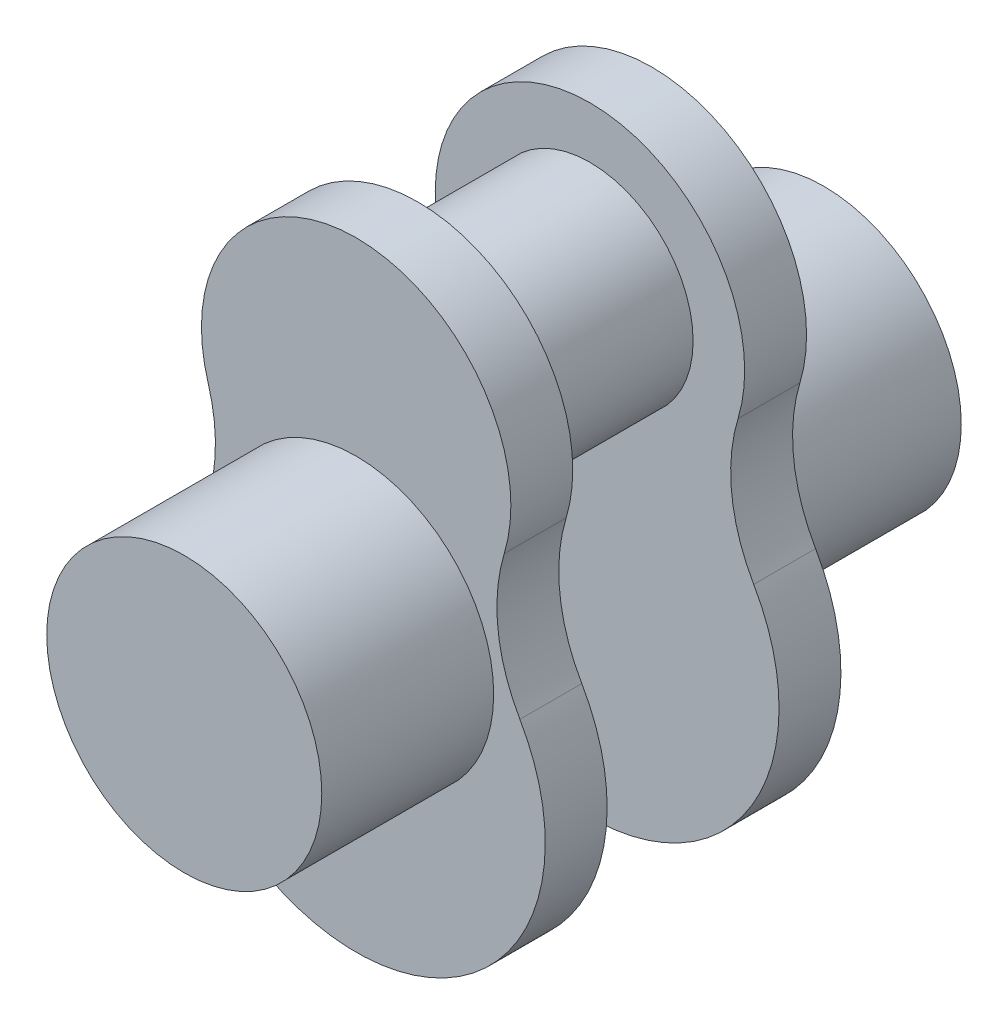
ISO-10303-21;
HEADER;
FILE_DESCRIPTION(('STEP AP214'),'2;1');
FILE_NAME('part.step','',(''),(''),'','','');
FILE_SCHEMA(('AUTOMOTIVE_DESIGN { 1 0 10303 214 1 1 1 1 }'));
ENDSEC;
DATA;
#1=APPLICATION_CONTEXT('core data for automotive mechanical design processes');
#2=APPLICATION_PROTOCOL_DEFINITION('international standard','automotive_design',2000,#1);
#3=PRODUCT_CONTEXT('',#1,'mechanical');
#4=PRODUCT('Part','Part','',(#3));
#5=PRODUCT_RELATED_PRODUCT_CATEGORY('part','',(#4));
#6=PRODUCT_DEFINITION_FORMATION('','',#4);
#7=PRODUCT_DEFINITION_CONTEXT('part definition',#1,'design');
#8=PRODUCT_DEFINITION('design','',#6,#7);
#9=PRODUCT_DEFINITION_SHAPE('','',#8);
#10=(LENGTH_UNIT() NAMED_UNIT(*) SI_UNIT(.MILLI.,.METRE.));
#11=(NAMED_UNIT(*) PLANE_ANGLE_UNIT() SI_UNIT($,.RADIAN.));
#12=(NAMED_UNIT(*) SI_UNIT($,.STERADIAN.) SOLID_ANGLE_UNIT());
#13=UNCERTAINTY_MEASURE_WITH_UNIT(LENGTH_MEASURE(1.E-05),#10,'distance_accuracy_value','');
#14=(GEOMETRIC_REPRESENTATION_CONTEXT(3) GLOBAL_UNCERTAINTY_ASSIGNED_CONTEXT((#13)) GLOBAL_UNIT_ASSIGNED_CONTEXT((#10,
#11,#12)) REPRESENTATION_CONTEXT('',''));
#15=CARTESIAN_POINT('',(0.,0.,0.));
#16=DIRECTION('',(0.,0.,1.));
#17=DIRECTION('',(1.,0.,0.));
#18=AXIS2_PLACEMENT_3D('',#15,#16,#17);
#19=CARTESIAN_POINT('',(45.466333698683,36.25,43.));
#20=DIRECTION('',(0.,0.,-1.));
#21=DIRECTION('',(-1.,0.,0.));
#22=AXIS2_PLACEMENT_3D('',#19,#20,#21);
#23=PLANE('',#22);
#24=CARTESIAN_POINT('',(90.9326673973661,22.5,43.));
#25=DIRECTION('',(0.,0.,-1.));
#26=DIRECTION('',(-1.,0.,0.));
#27=AXIS2_PLACEMENT_3D('',#24,#25,#26);
#28=CIRCLE('',#27,50.);
#29=CARTESIAN_POINT('',(47.6313972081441,-2.49999999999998,43.));
#30=VERTEX_POINT('',#29);
#31=CARTESIAN_POINT('',(43.0733687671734,36.9736842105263,43.));
#32=VERTEX_POINT('',#31);
#33=EDGE_CURVE('E185',#30,#32,#28,.T.);
#34=ORIENTED_EDGE('',*,*,#33,.T.);
#35=CARTESIAN_POINT('',(0.,50.,43.));
#36=DIRECTION('',(0.,0.,1.));
#37=DIRECTION('',(1.,0.,0.));
#38=AXIS2_PLACEMENT_3D('',#35,#36,#37);
#39=CIRCLE('',#38,45.);
#40=CARTESIAN_POINT('',(-43.0733687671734,36.9736842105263,43.));
#41=VERTEX_POINT('',#40);
#42=EDGE_CURVE('E104',#32,#41,#39,.T.);
#43=ORIENTED_EDGE('',*,*,#42,.T.);
#44=CARTESIAN_POINT('',(-90.9326673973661,22.5,43.));
#45=DIRECTION('',(0.,0.,-1.));
#46=DIRECTION('',(1.,0.,0.));
#47=AXIS2_PLACEMENT_3D('',#44,#45,#46);
#48=CIRCLE('',#47,50.);
#49=CARTESIAN_POINT('',(-47.6313972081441,-2.5,43.));
#50=VERTEX_POINT('',#49);
#51=EDGE_CURVE('E188',#41,#50,#48,.T.);
#52=ORIENTED_EDGE('',*,*,#51,.T.);
#53=CARTESIAN_POINT('',(0.,-30.,43.));
#54=DIRECTION('',(0.,0.,1.));
#55=DIRECTION('',(1.,0.,0.));
#56=AXIS2_PLACEMENT_3D('',#53,#54,#55);
#57=CIRCLE('',#56,55.);
#58=EDGE_CURVE('E72',#50,#30,#57,.T.);
#59=ORIENTED_EDGE('',*,*,#58,.T.);
#60=EDGE_LOOP('',(#34,#43,#52,#59));
#61=FACE_BOUND('',#60,.T.);
#62=CARTESIAN_POINT('',(0.,0.,43.));
#63=DIRECTION('',(0.,0.,-1.));
#64=DIRECTION('',(-1.,0.,0.));
#65=AXIS2_PLACEMENT_3D('',#62,#63,#64);
#66=CIRCLE('',#65,40.);
#67=CARTESIAN_POINT('',(-40.,0.,43.));
#68=VERTEX_POINT('',#67);
#69=EDGE_CURVE('E13',#68,#68,#66,.F.);
#70=ORIENTED_EDGE('',*,*,#69,.F.);
#71=EDGE_LOOP('',(#70));
#72=FACE_BOUND('',#71,.T.);
#73=ADVANCED_FACE('F55',(#61,#72),#23,.F.);
#74=CARTESIAN_POINT('',(0.,50.,25.));
#75=DIRECTION('',(0.,0.,-1.));
#76=DIRECTION('',(-1.,0.,0.));
#77=AXIS2_PLACEMENT_3D('',#74,#75,#76);
#78=CYLINDRICAL_SURFACE('',#77,30.);
#79=CARTESIAN_POINT('',(0.,50.,25.));
#80=DIRECTION('',(0.,0.,1.));
#81=DIRECTION('',(1.,0.,0.));
#82=AXIS2_PLACEMENT_3D('',#79,#80,#81);
#83=CIRCLE('',#82,30.);
#84=CARTESIAN_POINT('',(30.,50.,25.));
#85=VERTEX_POINT('',#84);
#86=EDGE_CURVE('E64',#85,#85,#83,.T.);
#87=ORIENTED_EDGE('',*,*,#86,.F.);
#88=EDGE_LOOP('',(#87));
#89=FACE_BOUND('',#88,.T.);
#90=CARTESIAN_POINT('',(0.,50.,-25.));
#91=DIRECTION('',(0.,0.,1.));
#92=DIRECTION('',(1.,0.,0.));
#93=AXIS2_PLACEMENT_3D('',#90,#91,#92);
#94=CIRCLE('',#93,30.);
#95=CARTESIAN_POINT('',(30.,50.,-25.));
#96=VERTEX_POINT('',#95);
#97=EDGE_CURVE('E142',#96,#96,#94,.T.);
#98=ORIENTED_EDGE('',*,*,#97,.T.);
#99=EDGE_LOOP('',(#98));
#100=FACE_BOUND('',#99,.T.);
#101=ADVANCED_FACE('F57',(#89,#100),#78,.T.);
#102=CARTESIAN_POINT('',(45.466333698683,36.25,25.));
#103=DIRECTION('',(0.,0.,-1.));
#104=DIRECTION('',(-1.,0.,0.));
#105=AXIS2_PLACEMENT_3D('',#102,#103,#104);
#106=PLANE('',#105);
#107=CARTESIAN_POINT('',(90.9326673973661,22.5,25.));
#108=DIRECTION('',(0.,0.,-1.));
#109=DIRECTION('',(-1.,0.,0.));
#110=AXIS2_PLACEMENT_3D('',#107,#108,#109);
#111=CIRCLE('',#110,50.);
#112=CARTESIAN_POINT('',(47.6313972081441,-2.49999999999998,25.));
#113=VERTEX_POINT('',#112);
#114=CARTESIAN_POINT('',(43.0733687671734,36.9736842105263,25.));
#115=VERTEX_POINT('',#114);
#116=EDGE_CURVE('E184',#113,#115,#111,.T.);
#117=ORIENTED_EDGE('',*,*,#116,.F.);
#118=CARTESIAN_POINT('',(0.,-30.,25.));
#119=DIRECTION('',(0.,0.,1.));
#120=DIRECTION('',(1.,0.,0.));
#121=AXIS2_PLACEMENT_3D('',#118,#119,#120);
#122=CIRCLE('',#121,55.);
#123=CARTESIAN_POINT('',(-47.6313972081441,-2.5,25.));
#124=VERTEX_POINT('',#123);
#125=EDGE_CURVE('E96',#124,#113,#122,.T.);
#126=ORIENTED_EDGE('',*,*,#125,.F.);
#127=CARTESIAN_POINT('',(-90.9326673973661,22.5,25.));
#128=DIRECTION('',(0.,0.,-1.));
#129=DIRECTION('',(1.,0.,0.));
#130=AXIS2_PLACEMENT_3D('',#127,#128,#129);
#131=CIRCLE('',#130,50.);
#132=CARTESIAN_POINT('',(-43.0733687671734,36.9736842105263,25.));
#133=VERTEX_POINT('',#132);
#134=EDGE_CURVE('E90',#133,#124,#131,.T.);
#135=ORIENTED_EDGE('',*,*,#134,.F.);
#136=CARTESIAN_POINT('',(0.,50.,25.));
#137=DIRECTION('',(0.,0.,1.));
#138=DIRECTION('',(1.,0.,0.));
#139=AXIS2_PLACEMENT_3D('',#136,#137,#138);
#140=CIRCLE('',#139,45.);
#141=EDGE_CURVE('E194',#115,#133,#140,.T.);
#142=ORIENTED_EDGE('',*,*,#141,.F.);
#143=EDGE_LOOP('',(#117,#126,#135,#142));
#144=FACE_BOUND('',#143,.T.);
#145=ORIENTED_EDGE('',*,*,#86,.T.);
#146=EDGE_LOOP('',(#145));
#147=FACE_BOUND('',#146,.T.);
#148=ADVANCED_FACE('F207',(#144,#147),#106,.T.);
#149=CARTESIAN_POINT('',(90.9326673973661,22.5,43.));
#150=DIRECTION('',(0.,0.,-1.));
#151=DIRECTION('',(-1.,0.,0.));
#152=AXIS2_PLACEMENT_3D('',#149,#150,#151);
#153=CYLINDRICAL_SURFACE('',#152,50.);
#154=ORIENTED_EDGE('',*,*,#116,.T.);
#155=DIRECTION('',(0.,0.,-1.));
#156=VECTOR('',#155,1.);
#157=CARTESIAN_POINT('',(43.0733687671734,36.9736842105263,43.));
#158=LINE('',#157,#156);
#159=EDGE_CURVE('E203',#32,#115,#158,.T.);
#160=ORIENTED_EDGE('',*,*,#159,.F.);
#161=ORIENTED_EDGE('',*,*,#33,.F.);
#162=DIRECTION('',(0.,0.,-1.));
#163=VECTOR('',#162,1.);
#164=CARTESIAN_POINT('',(47.6313972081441,-2.49999999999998,43.));
#165=LINE('',#164,#163);
#166=EDGE_CURVE('E191',#30,#113,#165,.T.);
#167=ORIENTED_EDGE('',*,*,#166,.T.);
#168=EDGE_LOOP('',(#154,#160,#161,#167));
#169=FACE_BOUND('',#168,.T.);
#170=ADVANCED_FACE('F239',(#169),#153,.F.);
#171=CARTESIAN_POINT('',(0.,50.,43.));
#172=DIRECTION('',(0.,0.,-1.));
#173=DIRECTION('',(-1.,0.,0.));
#174=AXIS2_PLACEMENT_3D('',#171,#172,#173);
#175=CYLINDRICAL_SURFACE('',#174,45.);
#176=ORIENTED_EDGE('',*,*,#141,.T.);
#177=DIRECTION('',(0.,0.,-1.));
#178=VECTOR('',#177,1.);
#179=CARTESIAN_POINT('',(-43.0733687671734,36.9736842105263,43.));
#180=LINE('',#179,#178);
#181=EDGE_CURVE('E201',#41,#133,#180,.T.);
#182=ORIENTED_EDGE('',*,*,#181,.F.);
#183=ORIENTED_EDGE('',*,*,#42,.F.);
#184=ORIENTED_EDGE('',*,*,#159,.T.);
#185=EDGE_LOOP('',(#176,#182,#183,#184));
#186=FACE_BOUND('',#185,.T.);
#187=ADVANCED_FACE('F246',(#186),#175,.T.);
#188=CARTESIAN_POINT('',(-90.9326673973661,22.5,43.));
#189=DIRECTION('',(0.,0.,-1.));
#190=DIRECTION('',(-1.,0.,0.));
#191=AXIS2_PLACEMENT_3D('',#188,#189,#190);
#192=CYLINDRICAL_SURFACE('',#191,50.);
#193=ORIENTED_EDGE('',*,*,#134,.T.);
#194=DIRECTION('',(0.,0.,-1.));
#195=VECTOR('',#194,1.);
#196=CARTESIAN_POINT('',(-47.6313972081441,-2.5,43.));
#197=LINE('',#196,#195);
#198=EDGE_CURVE('E199',#50,#124,#197,.T.);
#199=ORIENTED_EDGE('',*,*,#198,.F.);
#200=ORIENTED_EDGE('',*,*,#51,.F.);
#201=ORIENTED_EDGE('',*,*,#181,.T.);
#202=EDGE_LOOP('',(#193,#199,#200,#201));
#203=FACE_BOUND('',#202,.T.);
#204=ADVANCED_FACE('F243',(#203),#192,.F.);
#205=CARTESIAN_POINT('',(0.,-30.,43.));
#206=DIRECTION('',(0.,0.,-1.));
#207=DIRECTION('',(-1.,0.,0.));
#208=AXIS2_PLACEMENT_3D('',#205,#206,#207);
#209=CYLINDRICAL_SURFACE('',#208,55.);
#210=ORIENTED_EDGE('',*,*,#125,.T.);
#211=ORIENTED_EDGE('',*,*,#166,.F.);
#212=ORIENTED_EDGE('',*,*,#58,.F.);
#213=ORIENTED_EDGE('',*,*,#198,.T.);
#214=EDGE_LOOP('',(#210,#211,#212,#213));
#215=FACE_BOUND('',#214,.T.);
#216=ADVANCED_FACE('F241',(#215),#209,.T.);
#217=CARTESIAN_POINT('',(0.,0.,93.));
#218=DIRECTION('',(0.,0.,-1.));
#219=DIRECTION('',(-1.,0.,0.));
#220=AXIS2_PLACEMENT_3D('',#217,#218,#219);
#221=CYLINDRICAL_SURFACE('',#220,40.);
#222=CARTESIAN_POINT('',(0.,0.,93.));
#223=DIRECTION('',(0.,0.,1.));
#224=DIRECTION('',(1.,0.,0.));
#225=AXIS2_PLACEMENT_3D('',#222,#223,#224);
#226=CIRCLE('',#225,40.);
#227=CARTESIAN_POINT('',(40.,0.,93.));
#228=VERTEX_POINT('',#227);
#229=EDGE_CURVE('E181',#228,#228,#226,.T.);
#230=ORIENTED_EDGE('',*,*,#229,.F.);
#231=EDGE_LOOP('',(#230));
#232=FACE_BOUND('',#231,.T.);
#233=ORIENTED_EDGE('',*,*,#69,.T.);
#234=EDGE_LOOP('',(#233));
#235=FACE_BOUND('',#234,.T.);
#236=ADVANCED_FACE('F223',(#232,#235),#221,.T.);
#237=CARTESIAN_POINT('',(0.,0.,93.));
#238=DIRECTION('',(0.,0.,1.));
#239=DIRECTION('',(1.,0.,0.));
#240=AXIS2_PLACEMENT_3D('',#237,#238,#239);
#241=PLANE('',#240);
#242=ORIENTED_EDGE('',*,*,#229,.T.);
#243=EDGE_LOOP('',(#242));
#244=FACE_BOUND('',#243,.T.);
#245=ADVANCED_FACE('F215',(#244),#241,.T.);
#246=CARTESIAN_POINT('',(45.466333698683,36.25,-25.));
#247=DIRECTION('',(0.,0.,1.));
#248=DIRECTION('',(-1.,0.,0.));
#249=AXIS2_PLACEMENT_3D('',#246,#247,#248);
#250=PLANE('',#249);
#251=CARTESIAN_POINT('',(90.9326673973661,22.5,-25.));
#252=DIRECTION('',(0.,0.,-1.));
#253=DIRECTION('',(-1.,0.,0.));
#254=AXIS2_PLACEMENT_3D('',#251,#252,#253);
#255=CIRCLE('',#254,50.);
#256=CARTESIAN_POINT('',(47.6313972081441,-2.49999999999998,-25.));
#257=VERTEX_POINT('',#256);
#258=CARTESIAN_POINT('',(43.0733687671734,36.9736842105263,-25.));
#259=VERTEX_POINT('',#258);
#260=EDGE_CURVE('E137',#257,#259,#255,.T.);
#261=ORIENTED_EDGE('',*,*,#260,.T.);
#262=CARTESIAN_POINT('',(0.,50.,-25.));
#263=DIRECTION('',(0.,0.,1.));
#264=DIRECTION('',(1.,0.,0.));
#265=AXIS2_PLACEMENT_3D('',#262,#263,#264);
#266=CIRCLE('',#265,45.);
#267=CARTESIAN_POINT('',(-43.0733687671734,36.9736842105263,-25.));
#268=VERTEX_POINT('',#267);
#269=EDGE_CURVE('E153',#259,#268,#266,.T.);
#270=ORIENTED_EDGE('',*,*,#269,.T.);
#271=CARTESIAN_POINT('',(-90.9326673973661,22.5,-25.));
#272=DIRECTION('',(0.,0.,-1.));
#273=DIRECTION('',(1.,0.,0.));
#274=AXIS2_PLACEMENT_3D('',#271,#272,#273);
#275=CIRCLE('',#274,50.);
#276=CARTESIAN_POINT('',(-47.6313972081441,-2.5,-25.));
#277=VERTEX_POINT('',#276);
#278=EDGE_CURVE('E168',#268,#277,#275,.T.);
#279=ORIENTED_EDGE('',*,*,#278,.T.);
#280=CARTESIAN_POINT('',(0.,-30.,-25.));
#281=DIRECTION('',(0.,0.,1.));
#282=DIRECTION('',(1.,0.,0.));
#283=AXIS2_PLACEMENT_3D('',#280,#281,#282);
#284=CIRCLE('',#283,55.);
#285=EDGE_CURVE('E165',#277,#257,#284,.T.);
#286=ORIENTED_EDGE('',*,*,#285,.T.);
#287=EDGE_LOOP('',(#261,#270,#279,#286));
#288=FACE_BOUND('',#287,.T.);
#289=ORIENTED_EDGE('',*,*,#97,.F.);
#290=EDGE_LOOP('',(#289));
#291=FACE_BOUND('',#290,.T.);
#292=ADVANCED_FACE('F213',(#288,#291),#250,.T.);
#293=CARTESIAN_POINT('',(90.9326673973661,22.5,-43.));
#294=DIRECTION('',(0.,0.,1.));
#295=DIRECTION('',(1.,0.,0.));
#296=AXIS2_PLACEMENT_3D('',#293,#294,#295);
#297=CYLINDRICAL_SURFACE('',#296,50.);
#298=ORIENTED_EDGE('',*,*,#260,.F.);
#299=DIRECTION('',(0.,0.,1.));
#300=VECTOR('',#299,1.);
#301=CARTESIAN_POINT('',(47.6313972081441,-2.49999999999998,-43.));
#302=LINE('',#301,#300);
#303=CARTESIAN_POINT('',(47.6313972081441,-2.49999999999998,-43.));
#304=VERTEX_POINT('',#303);
#305=EDGE_CURVE('E131',#304,#257,#302,.T.);
#306=ORIENTED_EDGE('',*,*,#305,.F.);
#307=CARTESIAN_POINT('',(90.9326673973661,22.5,-43.));
#308=DIRECTION('',(0.,0.,-1.));
#309=DIRECTION('',(-1.,0.,0.));
#310=AXIS2_PLACEMENT_3D('',#307,#308,#309);
#311=CIRCLE('',#310,50.);
#312=CARTESIAN_POINT('',(43.0733687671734,36.9736842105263,-43.));
#313=VERTEX_POINT('',#312);
#314=EDGE_CURVE('E134',#304,#313,#311,.T.);
#315=ORIENTED_EDGE('',*,*,#314,.T.);
#316=DIRECTION('',(0.,0.,1.));
#317=VECTOR('',#316,1.);
#318=CARTESIAN_POINT('',(43.0733687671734,36.9736842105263,-43.));
#319=LINE('',#318,#317);
#320=EDGE_CURVE('E163',#313,#259,#319,.T.);
#321=ORIENTED_EDGE('',*,*,#320,.T.);
#322=EDGE_LOOP('',(#298,#306,#315,#321));
#323=FACE_BOUND('',#322,.T.);
#324=ADVANCED_FACE('F133',(#323),#297,.F.);
#325=CARTESIAN_POINT('',(0.,-30.,-43.));
#326=DIRECTION('',(0.,0.,1.));
#327=DIRECTION('',(1.,0.,0.));
#328=AXIS2_PLACEMENT_3D('',#325,#326,#327);
#329=CYLINDRICAL_SURFACE('',#328,55.);
#330=ORIENTED_EDGE('',*,*,#285,.F.);
#331=DIRECTION('',(0.,0.,1.));
#332=VECTOR('',#331,1.);
#333=CARTESIAN_POINT('',(-47.6313972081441,-2.5,-43.));
#334=LINE('',#333,#332);
#335=CARTESIAN_POINT('',(-47.6313972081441,-2.5,-43.));
#336=VERTEX_POINT('',#335);
#337=EDGE_CURVE('E143',#336,#277,#334,.T.);
#338=ORIENTED_EDGE('',*,*,#337,.F.);
#339=CARTESIAN_POINT('',(0.,-30.,-43.));
#340=DIRECTION('',(0.,0.,1.));
#341=DIRECTION('',(1.,0.,0.));
#342=AXIS2_PLACEMENT_3D('',#339,#340,#341);
#343=CIRCLE('',#342,55.);
#344=EDGE_CURVE('E149',#336,#304,#343,.T.);
#345=ORIENTED_EDGE('',*,*,#344,.T.);
#346=ORIENTED_EDGE('',*,*,#305,.T.);
#347=EDGE_LOOP('',(#330,#338,#345,#346));
#348=FACE_BOUND('',#347,.T.);
#349=ADVANCED_FACE('F155',(#348),#329,.T.);
#350=CARTESIAN_POINT('',(-90.9326673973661,22.5,-43.));
#351=DIRECTION('',(0.,0.,1.));
#352=DIRECTION('',(1.,0.,0.));
#353=AXIS2_PLACEMENT_3D('',#350,#351,#352);
#354=CYLINDRICAL_SURFACE('',#353,50.);
#355=ORIENTED_EDGE('',*,*,#278,.F.);
#356=DIRECTION('',(0.,0.,1.));
#357=VECTOR('',#356,1.);
#358=CARTESIAN_POINT('',(-43.0733687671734,36.9736842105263,-43.));
#359=LINE('',#358,#357);
#360=CARTESIAN_POINT('',(-43.0733687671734,36.9736842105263,-43.));
#361=VERTEX_POINT('',#360);
#362=EDGE_CURVE('E175',#361,#268,#359,.T.);
#363=ORIENTED_EDGE('',*,*,#362,.F.);
#364=CARTESIAN_POINT('',(-90.9326673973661,22.5,-43.));
#365=DIRECTION('',(0.,0.,-1.));
#366=DIRECTION('',(1.,0.,0.));
#367=AXIS2_PLACEMENT_3D('',#364,#365,#366);
#368=CIRCLE('',#367,50.);
#369=EDGE_CURVE('E156',#361,#336,#368,.T.);
#370=ORIENTED_EDGE('',*,*,#369,.T.);
#371=ORIENTED_EDGE('',*,*,#337,.T.);
#372=EDGE_LOOP('',(#355,#363,#370,#371));
#373=FACE_BOUND('',#372,.T.);
#374=ADVANCED_FACE('F294',(#373),#354,.F.);
#375=CARTESIAN_POINT('',(0.,50.,-43.));
#376=DIRECTION('',(0.,0.,1.));
#377=DIRECTION('',(1.,0.,0.));
#378=AXIS2_PLACEMENT_3D('',#375,#376,#377);
#379=CYLINDRICAL_SURFACE('',#378,45.);
#380=ORIENTED_EDGE('',*,*,#269,.F.);
#381=ORIENTED_EDGE('',*,*,#320,.F.);
#382=CARTESIAN_POINT('',(0.,50.,-43.));
#383=DIRECTION('',(0.,0.,1.));
#384=DIRECTION('',(1.,0.,0.));
#385=AXIS2_PLACEMENT_3D('',#382,#383,#384);
#386=CIRCLE('',#385,45.);
#387=EDGE_CURVE('E152',#313,#361,#386,.T.);
#388=ORIENTED_EDGE('',*,*,#387,.T.);
#389=ORIENTED_EDGE('',*,*,#362,.T.);
#390=EDGE_LOOP('',(#380,#381,#388,#389));
#391=FACE_BOUND('',#390,.T.);
#392=ADVANCED_FACE('F301',(#391),#379,.T.);
#393=CARTESIAN_POINT('',(45.466333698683,36.25,-43.));
#394=DIRECTION('',(0.,0.,1.));
#395=DIRECTION('',(-1.,0.,0.));
#396=AXIS2_PLACEMENT_3D('',#393,#394,#395);
#397=PLANE('',#396);
#398=CARTESIAN_POINT('',(0.,0.,-43.));
#399=DIRECTION('',(0.,0.,1.));
#400=DIRECTION('',(1.,0.,0.));
#401=AXIS2_PLACEMENT_3D('',#398,#399,#400);
#402=CIRCLE('',#401,40.);
#403=CARTESIAN_POINT('',(40.,0.,-43.));
#404=VERTEX_POINT('',#403);
#405=EDGE_CURVE('E337',#404,#404,#402,.T.);
#406=ORIENTED_EDGE('',*,*,#405,.T.);
#407=EDGE_LOOP('',(#406));
#408=FACE_BOUND('',#407,.T.);
#409=ORIENTED_EDGE('',*,*,#314,.F.);
#410=ORIENTED_EDGE('',*,*,#344,.F.);
#411=ORIENTED_EDGE('',*,*,#369,.F.);
#412=ORIENTED_EDGE('',*,*,#387,.F.);
#413=EDGE_LOOP('',(#409,#410,#411,#412));
#414=FACE_BOUND('',#413,.T.);
#415=ADVANCED_FACE('F147',(#408,#414),#397,.F.);
#416=CARTESIAN_POINT('',(0.,0.,-93.));
#417=DIRECTION('',(0.,0.,1.));
#418=DIRECTION('',(1.,0.,0.));
#419=AXIS2_PLACEMENT_3D('',#416,#417,#418);
#420=CYLINDRICAL_SURFACE('',#419,40.);
#421=CARTESIAN_POINT('',(0.,0.,-93.));
#422=DIRECTION('',(0.,0.,1.));
#423=DIRECTION('',(1.,0.,0.));
#424=AXIS2_PLACEMENT_3D('',#421,#422,#423);
#425=CIRCLE('',#424,40.);
#426=CARTESIAN_POINT('',(40.,0.,-93.));
#427=VERTEX_POINT('',#426);
#428=EDGE_CURVE('E166',#427,#427,#425,.T.);
#429=ORIENTED_EDGE('',*,*,#428,.T.);
#430=EDGE_LOOP('',(#429));
#431=FACE_BOUND('',#430,.T.);
#432=ORIENTED_EDGE('',*,*,#405,.F.);
#433=EDGE_LOOP('',(#432));
#434=FACE_BOUND('',#433,.T.);
#435=ADVANCED_FACE('F317',(#431,#434),#420,.T.);
#436=CARTESIAN_POINT('',(0.,0.,-93.));
#437=DIRECTION('',(0.,0.,-1.));
#438=DIRECTION('',(1.,0.,0.));
#439=AXIS2_PLACEMENT_3D('',#436,#437,#438);
#440=PLANE('',#439);
#441=ORIENTED_EDGE('',*,*,#428,.F.);
#442=EDGE_LOOP('',(#441));
#443=FACE_BOUND('',#442,.T.);
#444=ADVANCED_FACE('F325',(#443),#440,.T.);
#445=CLOSED_SHELL('',(#73,#101,#148,#170,#187,#204,#216,#236,#245,#292,#324,#349,#374,#392,#415,
#435,#444));
#446=MANIFOLD_SOLID_BREP('B2',#445);
#447=ADVANCED_BREP_SHAPE_REPRESENTATION('',(#18,#446),#14);
#448=SHAPE_DEFINITION_REPRESENTATION(#9,#447);
ENDSEC;
END-ISO-10303-21;
